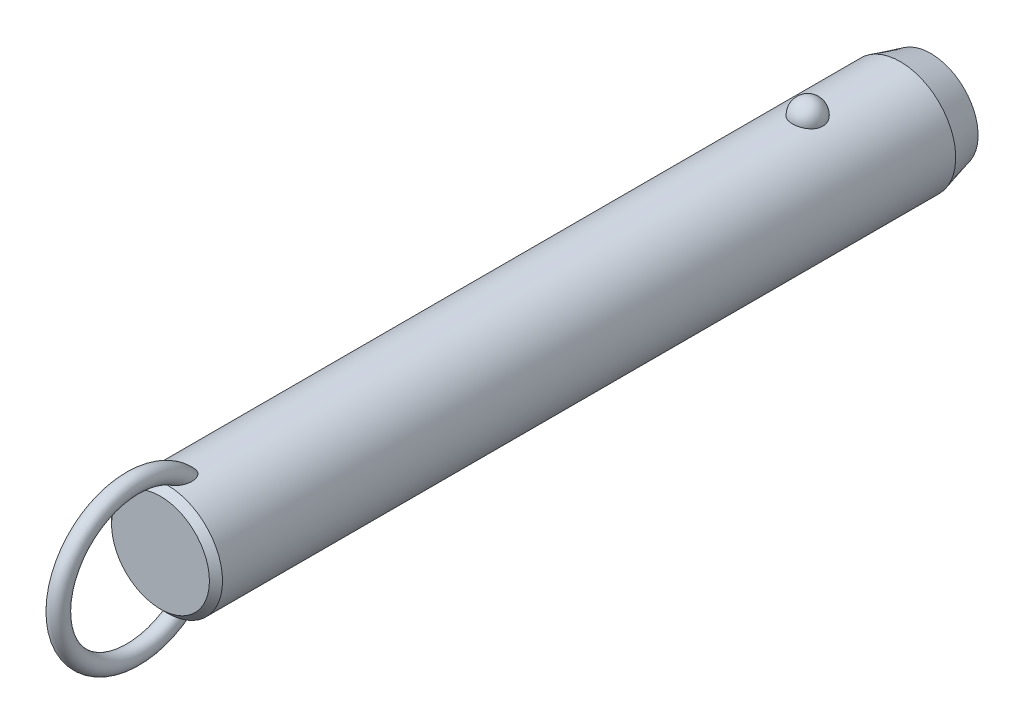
ISO-10303-21;
HEADER;
FILE_DESCRIPTION(('STEP AP214'),'2;1');
FILE_NAME('part.step','',(''),(''),'','','');
FILE_SCHEMA(('AUTOMOTIVE_DESIGN { 1 0 10303 214 1 1 1 1 }'));
ENDSEC;
DATA;
#1=APPLICATION_CONTEXT('core data for automotive mechanical design processes');
#2=APPLICATION_PROTOCOL_DEFINITION('international standard','automotive_design',2000,#1);
#3=PRODUCT_CONTEXT('',#1,'mechanical');
#4=PRODUCT('Part','Part','',(#3));
#5=PRODUCT_RELATED_PRODUCT_CATEGORY('part','',(#4));
#6=PRODUCT_DEFINITION_FORMATION('','',#4);
#7=PRODUCT_DEFINITION_CONTEXT('part definition',#1,'design');
#8=PRODUCT_DEFINITION('design','',#6,#7);
#9=PRODUCT_DEFINITION_SHAPE('','',#8);
#10=(LENGTH_UNIT() NAMED_UNIT(*) SI_UNIT(.MILLI.,.METRE.));
#11=(NAMED_UNIT(*) PLANE_ANGLE_UNIT() SI_UNIT($,.RADIAN.));
#12=(NAMED_UNIT(*) SI_UNIT($,.STERADIAN.) SOLID_ANGLE_UNIT());
#13=UNCERTAINTY_MEASURE_WITH_UNIT(LENGTH_MEASURE(1.E-05),#10,'distance_accuracy_value','');
#14=(GEOMETRIC_REPRESENTATION_CONTEXT(3) GLOBAL_UNCERTAINTY_ASSIGNED_CONTEXT((#13)) GLOBAL_UNIT_ASSIGNED_CONTEXT((#10,
#11,#12)) REPRESENTATION_CONTEXT('',''));
#15=CARTESIAN_POINT('',(0.,0.,0.));
#16=DIRECTION('',(0.,0.,1.));
#17=DIRECTION('',(1.,0.,0.));
#18=AXIS2_PLACEMENT_3D('',#15,#16,#17);
#19=CARTESIAN_POINT('',(0.,0.,132.));
#20=DIRECTION('',(0.,0.,-1.));
#21=DIRECTION('',(-1.,0.,0.));
#22=AXIS2_PLACEMENT_3D('',#19,#20,#21);
#23=CYLINDRICAL_SURFACE('',#22,12.7);
#24=CARTESIAN_POINT('',(3.46661256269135,12.2177165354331,-3.5));
#25=CARTESIAN_POINT('',(3.4666090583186,12.2177194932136,-3.30432790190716));
#26=CARTESIAN_POINT('',(3.45063567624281,12.2222841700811,-3.10861112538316));
#27=CARTESIAN_POINT('',(3.38712451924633,12.2400345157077,-2.72271899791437));
#28=CARTESIAN_POINT('',(3.33957415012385,12.2532236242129,-2.53254588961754));
#29=CARTESIAN_POINT('',(3.2141234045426,12.286724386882,-2.16324948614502));
#30=CARTESIAN_POINT('',(3.13623639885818,12.3070329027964,-1.98412136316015));
#31=CARTESIAN_POINT('',(2.95205930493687,12.3525018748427,-1.64180592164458));
#32=CARTESIAN_POINT('',(2.84577003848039,12.3776621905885,-1.47861814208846));
#33=CARTESIAN_POINT('',(2.60688050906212,12.4301712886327,-1.17190583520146));
#34=CARTESIAN_POINT('',(2.47415697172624,12.4575299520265,-1.02847897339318));
#35=CARTESIAN_POINT('',(2.18615174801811,12.5112810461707,-0.766177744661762));
#36=CARTESIAN_POINT('',(2.03087002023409,12.5376734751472,-0.64730342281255));
#37=CARTESIAN_POINT('',(1.70237334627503,12.5864761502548,-0.437732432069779));
#38=CARTESIAN_POINT('',(1.52920948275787,12.6088972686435,-0.346958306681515));
#39=CARTESIAN_POINT('',(1.16944170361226,12.6473352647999,-0.195750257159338));
#40=CARTESIAN_POINT('',(0.982839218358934,12.663352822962,-0.135313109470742));
#41=CARTESIAN_POINT('',(0.604961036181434,12.6869706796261,-0.0473241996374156));
#42=CARTESIAN_POINT('',(0.41382314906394,12.6947125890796,-0.0192185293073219));
#43=CARTESIAN_POINT('',(0.0293827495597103,12.7014203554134,0.0051725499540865));
#44=CARTESIAN_POINT('',(-0.163919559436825,12.7003870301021,0.00146092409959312));
#45=CARTESIAN_POINT('',(-0.544374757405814,12.689735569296,-0.0373939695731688));
#46=CARTESIAN_POINT('',(-0.731575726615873,12.6802364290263,-0.0721015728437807));
#47=CARTESIAN_POINT('',(-1.09733277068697,12.6538333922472,-0.171364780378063));
#48=CARTESIAN_POINT('',(-1.27588869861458,12.6369293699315,-0.235920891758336));
#49=CARTESIAN_POINT('',(-1.6204698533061,12.5973946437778,-0.393548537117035));
#50=CARTESIAN_POINT('',(-1.78641865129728,12.5747321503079,-0.486778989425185));
#51=CARTESIAN_POINT('',(-2.10030671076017,12.5261316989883,-0.699110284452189));
#52=CARTESIAN_POINT('',(-2.24824419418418,12.5001934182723,-0.818213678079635));
#53=CARTESIAN_POINT('',(-2.52491489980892,12.4472906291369,-1.08157124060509));
#54=CARTESIAN_POINT('',(-2.65324222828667,12.4203160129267,-1.22624992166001));
#55=CARTESIAN_POINT('',(-2.88410007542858,12.3687509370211,-1.53528325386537));
#56=CARTESIAN_POINT('',(-2.98662883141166,12.3441606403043,-1.69963924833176));
#57=CARTESIAN_POINT('',(-3.16432417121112,12.2998199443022,-2.04548497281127));
#58=CARTESIAN_POINT('',(-3.23917525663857,12.2801261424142,-2.22714424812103));
#59=CARTESIAN_POINT('',(-3.35800573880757,12.248167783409,-2.6009138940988));
#60=CARTESIAN_POINT('',(-3.4019860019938,12.2359030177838,-2.79302397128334));
#61=CARTESIAN_POINT('',(-3.45784812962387,12.2202347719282,-3.18140279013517));
#62=CARTESIAN_POINT('',(-3.46986123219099,12.2167950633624,-3.37765118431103));
#63=CARTESIAN_POINT('',(-3.46186273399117,12.2190638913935,-3.76943689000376));
#64=CARTESIAN_POINT('',(-3.44185196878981,12.2247721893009,-3.96497421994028));
#65=CARTESIAN_POINT('',(-3.37048652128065,12.2446381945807,-4.34881728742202));
#66=CARTESIAN_POINT('',(-3.31928253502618,12.2587552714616,-4.53715319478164));
#67=CARTESIAN_POINT('',(-3.18693461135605,12.2938237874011,-4.90231727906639));
#68=CARTESIAN_POINT('',(-3.1057895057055,12.3147754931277,-5.07914500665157));
#69=CARTESIAN_POINT('',(-2.91506431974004,12.3613125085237,-5.41732059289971));
#70=CARTESIAN_POINT('',(-2.80533587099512,12.3869217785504,-5.57858147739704));
#71=CARTESIAN_POINT('',(-2.560414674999,12.4398525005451,-5.88013283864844));
#72=CARTESIAN_POINT('',(-2.42522099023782,12.4671740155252,-6.02042254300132));
#73=CARTESIAN_POINT('',(-2.1323357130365,12.5205965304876,-6.27662798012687));
#74=CARTESIAN_POINT('',(-1.97456596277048,12.5466928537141,-6.3924554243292));
#75=CARTESIAN_POINT('',(-1.64115839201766,12.5946384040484,-6.59583547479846));
#76=CARTESIAN_POINT('',(-1.46552179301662,12.6164879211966,-6.68339001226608));
#77=CARTESIAN_POINT('',(-1.10356050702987,12.6532533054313,-6.82682153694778));
#78=CARTESIAN_POINT('',(-0.9173913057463,12.6682500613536,-6.8830698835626));
#79=CARTESIAN_POINT('',(-0.537836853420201,12.6900288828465,-6.96386887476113));
#80=CARTESIAN_POINT('',(-0.344452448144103,12.6968119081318,-6.9884232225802));
#81=CARTESIAN_POINT('',(0.0402577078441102,12.7013667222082,-7.00496469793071));
#82=CARTESIAN_POINT('',(0.231556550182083,12.6993008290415,-6.99753844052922));
#83=CARTESIAN_POINT('',(0.610105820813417,12.6867505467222,-6.9516636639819));
#84=CARTESIAN_POINT('',(0.797356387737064,12.6762664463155,-6.913216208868));
#85=CARTESIAN_POINT('',(1.16186657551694,12.6480587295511,-6.80658431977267));
#86=CARTESIAN_POINT('',(1.33915951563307,12.6303611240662,-6.73850666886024));
#87=CARTESIAN_POINT('',(1.67968518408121,12.5896027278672,-6.5745087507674));
#88=CARTESIAN_POINT('',(1.84291705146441,12.5665416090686,-6.47858678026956));
#89=CARTESIAN_POINT('',(2.15340192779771,12.5171072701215,-6.25982455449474));
#90=CARTESIAN_POINT('',(2.30037831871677,12.4906895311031,-6.13660186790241));
#91=CARTESIAN_POINT('',(2.5717412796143,12.4376567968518,-5.86739587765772));
#92=CARTESIAN_POINT('',(2.69612388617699,12.4110417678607,-5.72140858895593));
#93=CARTESIAN_POINT('',(2.92107785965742,12.360051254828,-5.40794137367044));
#94=CARTESIAN_POINT('',(3.02121329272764,12.3357209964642,-5.24014110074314));
#95=CARTESIAN_POINT('',(3.19236291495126,12.2925446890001,-4.88969865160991));
#96=CARTESIAN_POINT('',(3.26338839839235,12.2736965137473,-4.70706226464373));
#97=CARTESIAN_POINT('',(3.36788038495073,12.245404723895,-4.35469510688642));
#98=CARTESIAN_POINT('',(3.40484026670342,12.2351018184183,-4.18605935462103));
#99=CARTESIAN_POINT('',(3.45420764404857,12.2212564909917,-3.84496058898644));
#100=CARTESIAN_POINT('',(3.46661565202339,12.2177139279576,-3.67249765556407));
#101=CARTESIAN_POINT('',(3.46661256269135,12.2177165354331,-3.5));
#102=B_SPLINE_CURVE_WITH_KNOTS('',3,(#24,#25,#26,#27,#28,#29,#30,#31,#32,#33,#34,#35,#36,#37,
#38,#39,#40,#41,#42,#43,#44,#45,#46,#47,#48,#49,#50,#51,#52,#53,#54,#55,#56,#57,#58,#59,#60,#61,
#62,#63,#64,#65,#66,#67,#68,#69,#70,#71,#72,#73,#74,#75,#76,#77,#78,#79,#80,#81,#82,#83,#84,#85,
#86,#87,#88,#89,#90,#91,#92,#93,#94,#95,#96,#97,#98,#99,#100,#101),.UNSPECIFIED.,.T.,.F.,(4,2,2,
2,2,2,2,2,2,2,2,2,2,2,2,2,2,2,2,2,2,2,2,2,2,2,2,2,2,2,2,2,2,2,2,2,2,2,4),(0.,0.586396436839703,
1.17302689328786,1.7593990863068,2.34575431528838,2.93491084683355,3.52406845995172,
4.11158733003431,4.69904375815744,5.2762784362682,5.85345931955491,6.42265312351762,
6.99185659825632,7.56427334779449,8.136746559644,8.71981013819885,9.3029135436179,
9.89247258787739,10.4820150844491,11.0691335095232,11.6562366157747,12.2405256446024,
12.8248374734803,13.412244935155,13.9996740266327,14.5891883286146,15.1786623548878,
15.7609861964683,16.3432419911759,16.9148635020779,17.4864654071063,18.0560241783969,
18.6256177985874,19.2037609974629,19.7820055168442,20.3699810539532,20.957728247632,
21.4746855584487,21.9916320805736),.UNSPECIFIED.);
#103=CARTESIAN_POINT('',(3.46661256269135,12.2177165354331,-3.5));
#104=VERTEX_POINT('',#103);
#105=EDGE_CURVE('E41',#104,#104,#102,.T.);
#106=ORIENTED_EDGE('',*,*,#105,.T.);
#107=EDGE_LOOP('',(#106));
#108=FACE_BOUND('',#107,.T.);
#109=CARTESIAN_POINT('',(0.,0.,143.2));
#110=DIRECTION('',(0.,0.,1.));
#111=DIRECTION('',(1.,0.,0.));
#112=AXIS2_PLACEMENT_3D('',#109,#110,#111);
#113=CIRCLE('',#112,12.7);
#114=CARTESIAN_POINT('',(12.7,0.,143.2));
#115=VERTEX_POINT('',#114);
#116=EDGE_CURVE('E10',#115,#115,#113,.F.);
#117=ORIENTED_EDGE('',*,*,#116,.T.);
#118=EDGE_LOOP('',(#117));
#119=FACE_BOUND('',#118,.T.);
#120=CARTESIAN_POINT('',(-0.548122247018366,-12.6881662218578,136.943218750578));
#121=CARTESIAN_POINT('',(-0.648865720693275,-12.6838128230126,136.977926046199));
#122=CARTESIAN_POINT('',(-0.746398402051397,-12.6783867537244,137.022042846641));
#123=CARTESIAN_POINT('',(-0.932125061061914,-12.666091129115,137.126764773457));
#124=CARTESIAN_POINT('',(-1.02030388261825,-12.6592192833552,137.187396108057));
#125=CARTESIAN_POINT('',(-1.18487740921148,-12.6448747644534,137.321847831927));
#126=CARTESIAN_POINT('',(-1.26134296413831,-12.637406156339,137.395582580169));
#127=CARTESIAN_POINT('',(-1.4023120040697,-12.6225412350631,137.553604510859));
#128=CARTESIAN_POINT('',(-1.466814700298,-12.6151449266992,137.63789238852));
#129=CARTESIAN_POINT('',(-1.60714786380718,-12.5981718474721,137.849657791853));
#130=CARTESIAN_POINT('',(-1.67725126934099,-12.588900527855,137.980962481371));
#131=CARTESIAN_POINT('',(-1.79536591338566,-12.5725964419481,138.253247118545));
#132=CARTESIAN_POINT('',(-1.84333535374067,-12.5655679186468,138.394244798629));
#133=CARTESIAN_POINT('',(-1.93422576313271,-12.5519624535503,138.737645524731));
#134=CARTESIAN_POINT('',(-1.96788773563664,-12.5466298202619,138.942557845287));
#135=CARTESIAN_POINT('',(-1.9941399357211,-12.542463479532,139.251760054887));
#136=CARTESIAN_POINT('',(-1.99883864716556,-12.5417153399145,139.355298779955));
#137=CARTESIAN_POINT('',(-2.00078003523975,-12.5414074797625,139.56245124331));
#138=CARTESIAN_POINT('',(-1.99802449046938,-12.5418474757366,139.666064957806));
#139=CARTESIAN_POINT('',(-1.98336733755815,-12.5441750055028,139.91032076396));
#140=CARTESIAN_POINT('',(-1.96851430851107,-12.5465291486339,140.050780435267));
#141=CARTESIAN_POINT('',(-1.92707089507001,-12.5529612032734,140.329960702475));
#142=CARTESIAN_POINT('',(-1.90047458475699,-12.5570399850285,140.468680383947));
#143=CARTESIAN_POINT('',(-1.8361912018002,-12.5666008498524,140.74341135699));
#144=CARTESIAN_POINT('',(-1.79850828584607,-12.57208240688,140.879423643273));
#145=CARTESIAN_POINT('',(-1.71223796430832,-12.5841228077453,141.147842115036));
#146=CARTESIAN_POINT('',(-1.66365679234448,-12.5906810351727,141.280250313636));
#147=CARTESIAN_POINT('',(-1.5780450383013,-12.6016176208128,141.48548877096));
#148=CARTESIAN_POINT('',(-1.54477252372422,-12.6057501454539,141.559914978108));
#149=CARTESIAN_POINT('',(-1.47424480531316,-12.6141930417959,141.706839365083));
#150=CARTESIAN_POINT('',(-1.436990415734,-12.6185033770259,141.779337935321));
#151=CARTESIAN_POINT('',(-1.35825795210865,-12.6272207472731,141.921892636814));
#152=CARTESIAN_POINT('',(-1.31678520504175,-12.6316276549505,141.991951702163));
#153=CARTESIAN_POINT('',(-1.22917793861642,-12.6404532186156,142.129070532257));
#154=CARTESIAN_POINT('',(-1.18304514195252,-12.6448718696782,142.196131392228));
#155=CARTESIAN_POINT('',(-1.07246411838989,-12.6547893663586,142.343874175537));
#156=CARTESIAN_POINT('',(-1.00642239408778,-12.6602600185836,142.423384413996));
#157=CARTESIAN_POINT('',(-0.86444142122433,-12.6707460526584,142.573169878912));
#158=CARTESIAN_POINT('',(-0.788516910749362,-12.6757620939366,142.643458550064));
#159=CARTESIAN_POINT('',(-0.652215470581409,-12.6833591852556,142.748680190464));
#160=CARTESIAN_POINT('',(-0.59498203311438,-12.6861973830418,142.787624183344));
#161=CARTESIAN_POINT('',(-0.475269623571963,-12.6912445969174,142.856489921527));
#162=CARTESIAN_POINT('',(-0.412800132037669,-12.6934547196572,142.886427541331));
#163=CARTESIAN_POINT('',(-0.295749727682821,-12.6966636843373,142.92975652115));
#164=CARTESIAN_POINT('',(-0.241949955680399,-12.6978134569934,142.945218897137));
#165=CARTESIAN_POINT('',(-0.132508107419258,-12.6994261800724,142.966884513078));
#166=CARTESIAN_POINT('',(-0.0768679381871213,-12.6998898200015,142.973097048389));
#167=CARTESIAN_POINT('',(0.0347696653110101,-12.7000752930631,142.975583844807));
#168=CARTESIAN_POINT('',(0.0907676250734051,-12.6997954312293,142.971835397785));
#169=CARTESIAN_POINT('',(0.201283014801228,-12.6985255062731,142.954788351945));
#170=CARTESIAN_POINT('',(0.255799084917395,-12.6975348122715,142.941481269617));
#171=CARTESIAN_POINT('',(0.376042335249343,-12.6946091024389,142.90203792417));
#172=CARTESIAN_POINT('',(0.440950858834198,-12.6924943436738,142.873449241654));
#173=CARTESIAN_POINT('',(0.565350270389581,-12.6875639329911,142.806323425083));
#174=CARTESIAN_POINT('',(0.624828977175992,-12.6847467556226,142.767764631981));
#175=CARTESIAN_POINT('',(0.774116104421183,-12.6767252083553,142.656949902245));
#176=CARTESIAN_POINT('',(0.859449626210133,-12.6711344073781,142.578760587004));
#177=CARTESIAN_POINT('',(1.01789440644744,-12.6593922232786,142.410943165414));
#178=CARTESIAN_POINT('',(1.09096902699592,-12.653239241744,142.321282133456));
#179=CARTESIAN_POINT('',(1.22268793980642,-12.6411674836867,142.140265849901));
#180=CARTESIAN_POINT('',(1.28193986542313,-12.6352572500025,142.049345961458));
#181=CARTESIAN_POINT('',(1.39259777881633,-12.6235401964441,141.862792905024));
#182=CARTESIAN_POINT('',(1.44399707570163,-12.6177334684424,141.767155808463));
#183=CARTESIAN_POINT('',(1.53972870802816,-12.6064093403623,141.572273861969));
#184=CARTESIAN_POINT('',(1.58405262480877,-12.6008922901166,141.473024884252));
#185=CARTESIAN_POINT('',(1.66600705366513,-12.5903187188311,141.271772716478));
#186=CARTESIAN_POINT('',(1.70363651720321,-12.5852622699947,141.169769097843));
#187=CARTESIAN_POINT('',(1.77545379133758,-12.5753406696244,140.954358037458));
#188=CARTESIAN_POINT('',(1.80903453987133,-12.5705328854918,140.840745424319));
#189=CARTESIAN_POINT('',(1.86844163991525,-12.5618400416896,140.611457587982));
#190=CARTESIAN_POINT('',(1.89426665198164,-12.5579551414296,140.495782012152));
#191=CARTESIAN_POINT('',(1.9378546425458,-12.5513030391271,140.263007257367));
#192=CARTESIAN_POINT('',(1.95562640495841,-12.5485346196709,140.145909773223));
#193=CARTESIAN_POINT('',(1.98264463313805,-12.5442934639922,139.910747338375));
#194=CARTESIAN_POINT('',(1.99189298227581,-12.5428204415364,139.79268260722));
#195=CARTESIAN_POINT('',(2.00416068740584,-12.540871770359,139.480622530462));
#196=CARTESIAN_POINT('',(1.99944433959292,-12.541631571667,139.286229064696));
#197=CARTESIAN_POINT('',(1.96113755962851,-12.5476846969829,138.900309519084));
#198=CARTESIAN_POINT('',(1.92758341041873,-12.5529723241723,138.708780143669));
#199=CARTESIAN_POINT('',(1.83934342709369,-12.5661532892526,138.382272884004));
#200=CARTESIAN_POINT('',(1.79215440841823,-12.5730485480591,138.24524997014));
#201=CARTESIAN_POINT('',(1.67676242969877,-12.588958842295,137.980445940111));
#202=CARTESIAN_POINT('',(1.60859050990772,-12.597970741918,137.852651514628));
#203=CARTESIAN_POINT('',(1.46583832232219,-12.6152829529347,137.635800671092));
#204=CARTESIAN_POINT('',(1.39525727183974,-12.6233659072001,137.54410500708));
#205=CARTESIAN_POINT('',(1.23992594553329,-12.6395676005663,137.373485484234));
#206=CARTESIAN_POINT('',(1.15517932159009,-12.6476863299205,137.294558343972));
#207=CARTESIAN_POINT('',(0.971995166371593,-12.6630846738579,137.152643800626));
#208=CARTESIAN_POINT('',(0.873456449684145,-12.6703572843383,137.089784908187));
#209=CARTESIAN_POINT('',(0.665847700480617,-12.6829569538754,136.984487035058));
#210=CARTESIAN_POINT('',(0.556784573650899,-12.688285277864,136.942034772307));
#211=CARTESIAN_POINT('',(0.347338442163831,-12.6956226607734,136.884443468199));
#212=CARTESIAN_POINT('',(0.247759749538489,-12.6979816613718,136.866399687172));
#213=CARTESIAN_POINT('',(0.0470218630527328,-12.7003077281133,136.848600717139));
#214=CARTESIAN_POINT('',(-0.0541350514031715,-12.7002779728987,136.848821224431));
#215=CARTESIAN_POINT('',(-0.221414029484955,-12.6982482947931,136.864363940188));
#216=CARTESIAN_POINT('',(-0.288055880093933,-12.6969033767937,136.874666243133));
#217=CARTESIAN_POINT('',(-0.419599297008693,-12.6932369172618,136.90313489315));
#218=CARTESIAN_POINT('',(-0.484501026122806,-12.6909154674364,136.921300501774));
#219=CARTESIAN_POINT('',(-0.548122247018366,-12.6881662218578,136.943218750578));
#220=B_SPLINE_CURVE_WITH_KNOTS('',3,(#120,#121,#122,#123,#124,#125,#126,#127,#128,#129,#130,
#131,#132,#133,#134,#135,#136,#137,#138,#139,#140,#141,#142,#143,#144,#145,#146,#147,#148,#149,
#150,#151,#152,#153,#154,#155,#156,#157,#158,#159,#160,#161,#162,#163,#164,#165,#166,#167,#168,
#169,#170,#171,#172,#173,#174,#175,#176,#177,#178,#179,#180,#181,#182,#183,#184,#185,#186,#187,
#188,#189,#190,#191,#192,#193,#194,#195,#196,#197,#198,#199,#200,#201,#202,#203,#204,#205,#206,
#207,#208,#209,#210,#211,#212,#213,#214,#215,#216,#217,#218,#219),.UNSPECIFIED.,.T.,.F.,(4,2,2,
2,2,2,2,2,2,2,2,2,2,2,2,2,2,2,2,2,2,2,2,2,2,2,2,2,2,2,2,2,2,2,2,2,2,2,2,2,2,2,2,2,2,2,2,2,2,4),
(0.,0.31964225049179,0.639794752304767,0.957927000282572,1.27608021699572,1.72100165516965,
2.16675988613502,2.78630021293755,3.09705782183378,3.40774128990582,3.83096358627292,
4.25439969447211,4.67767724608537,5.10071330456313,5.34550297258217,5.59024267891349,
5.83467707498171,6.07902143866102,6.38891080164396,6.69834321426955,6.9056091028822,
7.11250749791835,7.27977315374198,7.44687060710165,7.61434932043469,7.78197685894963,
7.99365544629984,8.20579780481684,8.55147335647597,8.89816429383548,9.22375138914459,
9.54961437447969,9.8758622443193,10.202161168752,10.557587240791,10.9130746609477,
11.2681734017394,11.6231936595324,12.2046601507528,12.7853961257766,13.219164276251,
13.6522938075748,13.9989174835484,14.3454519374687,14.6946768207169,15.0436740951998,
15.3457513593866,15.6474266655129,15.8493051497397,16.0511646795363),.UNSPECIFIED.);
#221=CARTESIAN_POINT('',(-0.548122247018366,-12.6881662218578,136.943218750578));
#222=VERTEX_POINT('',#221);
#223=EDGE_CURVE('E60',#222,#222,#220,.T.);
#224=ORIENTED_EDGE('',*,*,#223,.T.);
#225=EDGE_LOOP('',(#224));
#226=FACE_BOUND('',#225,.T.);
#227=CARTESIAN_POINT('',(-0.548122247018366,12.6881662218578,136.943218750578));
#228=CARTESIAN_POINT('',(-0.459436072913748,12.6919968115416,136.912673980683));
#229=CARTESIAN_POINT('',(-0.368189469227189,12.6949996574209,136.889391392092));
#230=CARTESIAN_POINT('',(-0.183024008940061,12.6990186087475,136.858406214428));
#231=CARTESIAN_POINT('',(-0.0891049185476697,12.7000345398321,136.850704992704));
#232=CARTESIAN_POINT('',(0.0987147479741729,12.6999636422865,136.851245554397));
#233=CARTESIAN_POINT('',(0.192615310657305,12.6988761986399,136.859492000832));
#234=CARTESIAN_POINT('',(0.377658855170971,12.6947211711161,136.891551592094));
#235=CARTESIAN_POINT('',(0.468801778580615,12.6916535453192,136.915365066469));
#236=CARTESIAN_POINT('',(0.645809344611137,12.6838788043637,136.97745651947));
#237=CARTESIAN_POINT('',(0.731679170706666,12.6791733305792,137.015720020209));
#238=CARTESIAN_POINT('',(0.896315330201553,12.6686004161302,137.105120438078));
#239=CARTESIAN_POINT('',(0.97508059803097,12.6627328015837,137.156259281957));
#240=CARTESIAN_POINT('',(1.12963655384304,12.6499161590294,137.27367820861));
#241=CARTESIAN_POINT('',(1.20478673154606,12.6429194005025,137.340792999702));
#242=CARTESIAN_POINT('',(1.34448241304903,12.6288282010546,137.48522507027));
#243=CARTESIAN_POINT('',(1.40902173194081,12.621733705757,137.562548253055));
#244=CARTESIAN_POINT('',(1.55208211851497,12.6050877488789,137.759247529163));
#245=CARTESIAN_POINT('',(1.62510490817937,12.5957546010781,137.882654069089));
#246=CARTESIAN_POINT('',(1.7501904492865,12.5789823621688,138.139769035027));
#247=CARTESIAN_POINT('',(1.8022137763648,12.5715468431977,138.273496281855));
#248=CARTESIAN_POINT('',(1.90309965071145,12.5567434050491,138.598351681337));
#249=CARTESIAN_POINT('',(1.94342317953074,12.5504515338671,138.792161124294));
#250=CARTESIAN_POINT('',(1.99332997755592,12.5426147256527,139.18378810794));
#251=CARTESIAN_POINT('',(2.00285305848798,12.5410790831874,139.381612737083));
#252=CARTESIAN_POINT('',(1.99678999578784,12.5420407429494,139.716642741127));
#253=CARTESIAN_POINT('',(1.98794117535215,12.5434564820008,139.854042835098));
#254=CARTESIAN_POINT('',(1.95865119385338,12.5480641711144,140.127639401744));
#255=CARTESIAN_POINT('',(1.93820436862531,12.5512569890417,140.263835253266));
#256=CARTESIAN_POINT('',(1.88647896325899,12.5591352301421,140.534249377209));
#257=CARTESIAN_POINT('',(1.85518800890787,12.5638223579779,140.668465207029));
#258=CARTESIAN_POINT('',(1.78217886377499,12.5743868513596,140.933936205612));
#259=CARTESIAN_POINT('',(1.74046509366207,12.5802637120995,141.065192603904));
#260=CARTESIAN_POINT('',(1.66024095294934,12.5910571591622,141.286085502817));
#261=CARTESIAN_POINT('',(1.62434772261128,12.5957535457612,141.376690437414));
#262=CARTESIAN_POINT('',(1.54709009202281,12.6054762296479,141.555512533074));
#263=CARTESIAN_POINT('',(1.50572681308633,12.6105024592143,141.643730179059));
#264=CARTESIAN_POINT('',(1.41728020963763,12.620748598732,141.816932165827));
#265=CARTESIAN_POINT('',(1.37021377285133,12.625967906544,141.901925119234));
#266=CARTESIAN_POINT('',(1.26969620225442,12.6364721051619,142.068007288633));
#267=CARTESIAN_POINT('',(1.21624929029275,12.6417569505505,142.149099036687));
#268=CARTESIAN_POINT('',(1.10304413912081,12.6521331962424,142.304702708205));
#269=CARTESIAN_POINT('',(1.04340936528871,12.657226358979,142.379303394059));
#270=CARTESIAN_POINT('',(0.915919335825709,12.667090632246,142.521324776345));
#271=CARTESIAN_POINT('',(0.848064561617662,12.6718617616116,142.58874589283));
#272=CARTESIAN_POINT('',(0.717035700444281,12.67987711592,142.700624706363));
#273=CARTESIAN_POINT('',(0.655526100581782,12.6832377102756,142.746997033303));
#274=CARTESIAN_POINT('',(0.525985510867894,12.6892676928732,142.829619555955));
#275=CARTESIAN_POINT('',(0.457969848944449,12.6919386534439,142.865892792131));
#276=CARTESIAN_POINT('',(0.334859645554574,12.695691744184,142.916657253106));
#277=CARTESIAN_POINT('',(0.281116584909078,12.6970073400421,142.934373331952));
#278=CARTESIAN_POINT('',(0.171425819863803,12.6989609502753,142.960642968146));
#279=CARTESIAN_POINT('',(0.115480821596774,12.699599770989,142.969207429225));
#280=CARTESIAN_POINT('',(0.00272618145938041,12.7001251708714,142.976253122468));
#281=CARTESIAN_POINT('',(-0.0540859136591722,12.7000089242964,142.974696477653));
#282=CARTESIAN_POINT('',(-0.16654462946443,12.6990328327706,142.961600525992));
#283=CARTESIAN_POINT('',(-0.222190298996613,12.6981724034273,142.950053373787));
#284=CARTESIAN_POINT('',(-0.342018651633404,12.695562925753,142.914912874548));
#285=CARTESIAN_POINT('',(-0.405606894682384,12.6936676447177,142.88933225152));
#286=CARTESIAN_POINT('',(-0.527815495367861,12.6891754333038,142.828311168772));
#287=CARTESIAN_POINT('',(-0.586425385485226,12.6865770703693,142.792850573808));
#288=CARTESIAN_POINT('',(-0.731842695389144,12.6792129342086,142.691496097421));
#289=CARTESIAN_POINT('',(-0.81470941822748,12.6740767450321,142.6200395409));
#290=CARTESIAN_POINT('',(-0.969101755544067,12.6632083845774,142.46589007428));
#291=CARTESIAN_POINT('',(-1.04059564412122,12.6574746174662,142.383166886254));
#292=CARTESIAN_POINT('',(-1.16981116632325,12.6461638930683,142.215809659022));
#293=CARTESIAN_POINT('',(-1.22811369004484,12.6405994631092,142.131616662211));
#294=CARTESIAN_POINT('',(-1.33743405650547,12.6295007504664,141.958579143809));
#295=CARTESIAN_POINT('',(-1.38844577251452,12.6239664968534,141.869730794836));
#296=CARTESIAN_POINT('',(-1.48400702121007,12.6130898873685,141.688389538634));
#297=CARTESIAN_POINT('',(-1.52854232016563,12.6077479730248,141.595889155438));
#298=CARTESIAN_POINT('',(-1.61150113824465,12.5974127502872,141.408160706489));
#299=CARTESIAN_POINT('',(-1.64992317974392,12.5924195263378,141.312931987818));
#300=CARTESIAN_POINT('',(-1.73468589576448,12.581070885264,141.08289362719));
#301=CARTESIAN_POINT('',(-1.77831261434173,12.5749388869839,140.947066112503));
#302=CARTESIAN_POINT('',(-1.85439734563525,12.5639437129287,140.672212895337));
#303=CARTESIAN_POINT('',(-1.88684994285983,12.5590811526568,140.533185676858));
#304=CARTESIAN_POINT('',(-1.94008483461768,12.550968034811,140.25309235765));
#305=CARTESIAN_POINT('',(-1.96088706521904,12.5477147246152,140.112030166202));
#306=CARTESIAN_POINT('',(-1.99000539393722,12.5431291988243,139.828668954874));
#307=CARTESIAN_POINT('',(-1.99832911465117,12.5417958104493,139.686370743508));
#308=CARTESIAN_POINT('',(-2.00166624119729,12.5412674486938,139.357627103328));
#309=CARTESIAN_POINT('',(-1.99178843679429,12.5428579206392,139.171088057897));
#310=CARTESIAN_POINT('',(-1.94455183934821,12.5502731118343,138.80162404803));
#311=CARTESIAN_POINT('',(-1.90724032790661,12.5560905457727,138.618693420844));
#312=CARTESIAN_POINT('',(-1.81330718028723,12.5699462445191,138.304848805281));
#313=CARTESIAN_POINT('',(-1.76338820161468,12.5771273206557,138.171910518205));
#314=CARTESIAN_POINT('',(-1.64305018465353,12.593414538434,137.915681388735));
#315=CARTESIAN_POINT('',(-1.57265346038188,12.6025185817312,137.792380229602));
#316=CARTESIAN_POINT('',(-1.42634956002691,12.6198178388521,137.583564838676));
#317=CARTESIAN_POINT('',(-1.35423772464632,12.6278405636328,137.495384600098));
#318=CARTESIAN_POINT('',(-1.19645664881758,12.6437632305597,137.332107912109));
#319=CARTESIAN_POINT('',(-1.1108053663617,12.6516633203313,137.256994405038));
#320=CARTESIAN_POINT('',(-0.947219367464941,12.6648319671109,137.137811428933));
#321=CARTESIAN_POINT('',(-0.871624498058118,12.670300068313,137.090541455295));
#322=CARTESIAN_POINT('',(-0.714161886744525,12.6801492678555,137.0077413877));
#323=CARTESIAN_POINT('',(-0.632295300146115,12.684530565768,136.97220913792));
#324=CARTESIAN_POINT('',(-0.548122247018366,12.6881662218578,136.943218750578));
#325=B_SPLINE_CURVE_WITH_KNOTS('',3,(#227,#228,#229,#230,#231,#232,#233,#234,#235,#236,#237,
#238,#239,#240,#241,#242,#243,#244,#245,#246,#247,#248,#249,#250,#251,#252,#253,#254,#255,#256,
#257,#258,#259,#260,#261,#262,#263,#264,#265,#266,#267,#268,#269,#270,#271,#272,#273,#274,#275,
#276,#277,#278,#279,#280,#281,#282,#283,#284,#285,#286,#287,#288,#289,#290,#291,#292,#293,#294,
#295,#296,#297,#298,#299,#300,#301,#302,#303,#304,#305,#306,#307,#308,#309,#310,#311,#312,#313,
#314,#315,#316,#317,#318,#319,#320,#321,#322,#323,#324),.UNSPECIFIED.,.T.,.F.,(4,2,2,2,2,2,2,2,
2,2,2,2,2,2,2,2,2,2,2,2,2,2,2,2,2,2,2,2,2,2,2,2,2,2,2,2,2,2,2,2,2,2,2,2,2,2,2,2,4),(0.,
0.281328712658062,0.562682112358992,0.844117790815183,1.12555942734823,1.40671982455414,
1.68792232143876,1.98972294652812,2.29169886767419,2.72039860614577,3.14989948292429,
3.74084916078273,4.33295293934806,4.74554109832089,5.15833092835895,5.57159335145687,
5.98468079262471,6.27722775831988,6.56971484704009,6.86135609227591,7.15280542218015,
7.43927407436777,7.72572595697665,7.95635862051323,8.18646071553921,8.35559393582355,
8.52452541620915,8.69408946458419,8.86378678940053,9.06834348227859,9.27332014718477,
9.60010414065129,9.92778432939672,10.2350252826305,10.5425229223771,10.8506864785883,
11.15892440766,11.5867893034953,12.0148612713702,12.4421984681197,12.8692745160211,
13.4279365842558,13.9856380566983,14.4107062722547,14.835313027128,15.1765567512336,
15.517351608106,15.7844129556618,16.051425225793),.UNSPECIFIED.);
#326=CARTESIAN_POINT('',(-0.548122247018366,12.6881662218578,136.943218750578));
#327=VERTEX_POINT('',#326);
#328=EDGE_CURVE('E67',#327,#327,#325,.T.);
#329=ORIENTED_EDGE('',*,*,#328,.T.);
#330=EDGE_LOOP('',(#329));
#331=FACE_BOUND('',#330,.T.);
#332=CARTESIAN_POINT('',(0.,0.,-24.6999999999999));
#333=DIRECTION('',(0.,0.,-1.));
#334=DIRECTION('',(-1.,0.,0.));
#335=AXIS2_PLACEMENT_3D('',#332,#333,#334);
#336=CIRCLE('',#335,12.7);
#337=CARTESIAN_POINT('',(-12.7,0.,-24.6999999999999));
#338=VERTEX_POINT('',#337);
#339=EDGE_CURVE('E57',#338,#338,#336,.F.);
#340=ORIENTED_EDGE('',*,*,#339,.T.);
#341=EDGE_LOOP('',(#340));
#342=FACE_BOUND('',#341,.T.);
#343=ADVANCED_FACE('F37',(#108,#119,#226,#331,#342),#23,.T.);
#344=CARTESIAN_POINT('',(0.,0.,-31.7));
#345=DIRECTION('',(0.,0.,-1.));
#346=DIRECTION('',(-1.,0.,0.));
#347=AXIS2_PLACEMENT_3D('',#344,#345,#346);
#348=PLANE('',#347);
#349=CARTESIAN_POINT('',(0.,0.,-31.7));
#350=DIRECTION('',(0.,0.,-1.));
#351=DIRECTION('',(-1.,0.,0.));
#352=AXIS2_PLACEMENT_3D('',#349,#350,#351);
#353=CIRCLE('',#352,10.8243556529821);
#354=CARTESIAN_POINT('',(-10.8243556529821,0.,-31.7));
#355=VERTEX_POINT('',#354);
#356=EDGE_CURVE('E66',#355,#355,#353,.T.);
#357=ORIENTED_EDGE('',*,*,#356,.T.);
#358=EDGE_LOOP('',(#357));
#359=FACE_BOUND('',#358,.T.);
#360=ADVANCED_FACE('F85',(#359),#348,.T.);
#361=CARTESIAN_POINT('',(0.,0.,-31.7));
#362=DIRECTION('',(0.,0.,1.));
#363=DIRECTION('',(1.,0.,0.));
#364=AXIS2_PLACEMENT_3D('',#361,#362,#363);
#365=CONICAL_SURFACE('',#364,10.8243556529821,0.261799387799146);
#366=ORIENTED_EDGE('',*,*,#339,.F.);
#367=EDGE_LOOP('',(#366));
#368=FACE_BOUND('',#367,.T.);
#369=ORIENTED_EDGE('',*,*,#356,.F.);
#370=EDGE_LOOP('',(#369));
#371=FACE_BOUND('',#370,.T.);
#372=ADVANCED_FACE('F83',(#368,#371),#365,.T.);
#373=CARTESIAN_POINT('',(0.,0.,144.7));
#374=DIRECTION('',(0.,0.,1.));
#375=DIRECTION('',(1.,0.,0.));
#376=AXIS2_PLACEMENT_3D('',#373,#374,#375);
#377=PLANE('',#376);
#378=CARTESIAN_POINT('',(0.,0.,144.7));
#379=DIRECTION('',(0.,0.,1.));
#380=DIRECTION('',(1.,0.,0.));
#381=AXIS2_PLACEMENT_3D('',#378,#379,#380);
#382=CIRCLE('',#381,11.2);
#383=CARTESIAN_POINT('',(11.2,0.,144.7));
#384=VERTEX_POINT('',#383);
#385=EDGE_CURVE('E50',#384,#384,#382,.T.);
#386=ORIENTED_EDGE('',*,*,#385,.T.);
#387=EDGE_LOOP('',(#386));
#388=FACE_BOUND('',#387,.T.);
#389=ADVANCED_FACE('F77',(#388),#377,.T.);
#390=CARTESIAN_POINT('',(0.,0.,151.05));
#391=DIRECTION('',(1.,0.,0.));
#392=DIRECTION('',(0.,0.,-1.));
#393=AXIS2_PLACEMENT_3D('',#390,#391,#392);
#394=TOROIDAL_SURFACE('',#393,17.05,2.);
#395=ORIENTED_EDGE('',*,*,#328,.F.);
#396=EDGE_LOOP('',(#395));
#397=FACE_BOUND('',#396,.T.);
#398=ORIENTED_EDGE('',*,*,#223,.F.);
#399=EDGE_LOOP('',(#398));
#400=FACE_BOUND('',#399,.T.);
#401=ADVANCED_FACE('F73',(#397,#400),#394,.T.);
#402=CARTESIAN_POINT('',(0.,0.,144.7));
#403=DIRECTION('',(0.,0.,-1.));
#404=DIRECTION('',(-1.,0.,0.));
#405=AXIS2_PLACEMENT_3D('',#402,#403,#404);
#406=CONICAL_SURFACE('',#405,11.2,0.785398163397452);
#407=ORIENTED_EDGE('',*,*,#116,.F.);
#408=EDGE_LOOP('',(#407));
#409=FACE_BOUND('',#408,.T.);
#410=ORIENTED_EDGE('',*,*,#385,.F.);
#411=EDGE_LOOP('',(#410));
#412=FACE_BOUND('',#411,.T.);
#413=ADVANCED_FACE('F39',(#409,#412),#406,.T.);
#414=CARTESIAN_POINT('',(0.,12.7,-3.5));
#415=DIRECTION('',(0.,1.,0.));
#416=DIRECTION('',(0.,0.,-1.));
#417=AXIS2_PLACEMENT_3D('',#414,#415,#416);
#418=SPHERICAL_SURFACE('',#417,3.5);
#419=ORIENTED_EDGE('',*,*,#105,.F.);
#420=EDGE_LOOP('',(#419));
#421=FACE_BOUND('',#420,.T.);
#422=ADVANCED_FACE('F79',(#421),#418,.T.);
#423=CLOSED_SHELL('',(#343,#360,#372,#389,#401,#413,#422));
#424=MANIFOLD_SOLID_BREP('B2',#423);
#425=ADVANCED_BREP_SHAPE_REPRESENTATION('',(#18,#424),#14);
#426=SHAPE_DEFINITION_REPRESENTATION(#9,#425);
ENDSEC;
END-ISO-10303-21;
